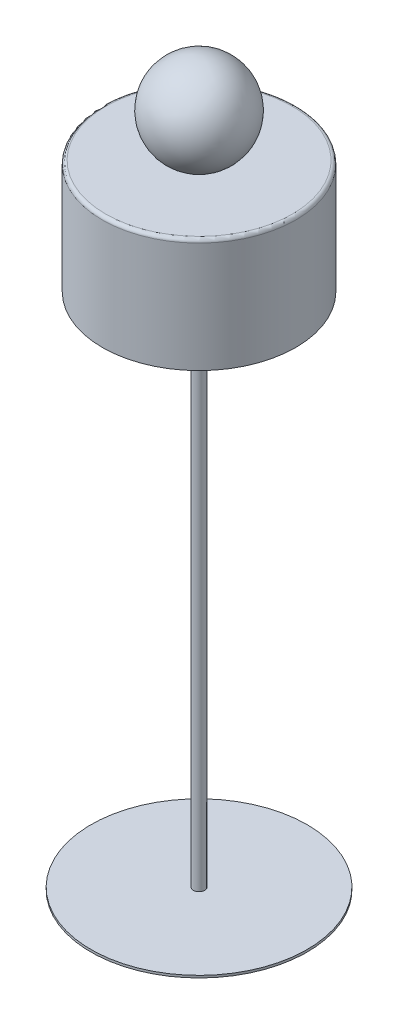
ISO-10303-21;
HEADER;
FILE_DESCRIPTION(('STEP AP214'),'2;1');
FILE_NAME('part.step','',(''),(''),'','','');
FILE_SCHEMA(('AUTOMOTIVE_DESIGN { 1 0 10303 214 1 1 1 1 }'));
ENDSEC;
DATA;
#1=APPLICATION_CONTEXT('core data for automotive mechanical design processes');
#2=APPLICATION_PROTOCOL_DEFINITION('international standard','automotive_design',2000,#1);
#3=PRODUCT_CONTEXT('',#1,'mechanical');
#4=PRODUCT('Part','Part','',(#3));
#5=PRODUCT_RELATED_PRODUCT_CATEGORY('part','',(#4));
#6=PRODUCT_DEFINITION_FORMATION('','',#4);
#7=PRODUCT_DEFINITION_CONTEXT('part definition',#1,'design');
#8=PRODUCT_DEFINITION('design','',#6,#7);
#9=PRODUCT_DEFINITION_SHAPE('','',#8);
#10=(LENGTH_UNIT() NAMED_UNIT(*) SI_UNIT(.MILLI.,.METRE.));
#11=(NAMED_UNIT(*) PLANE_ANGLE_UNIT() SI_UNIT($,.RADIAN.));
#12=(NAMED_UNIT(*) SI_UNIT($,.STERADIAN.) SOLID_ANGLE_UNIT());
#13=UNCERTAINTY_MEASURE_WITH_UNIT(LENGTH_MEASURE(1.E-05),#10,'distance_accuracy_value','');
#14=(GEOMETRIC_REPRESENTATION_CONTEXT(3) GLOBAL_UNCERTAINTY_ASSIGNED_CONTEXT((#13)) GLOBAL_UNIT_ASSIGNED_CONTEXT((#10,
#11,#12)) REPRESENTATION_CONTEXT('',''));
#15=CARTESIAN_POINT('',(0.,0.,0.));
#16=DIRECTION('',(0.,0.,1.));
#17=DIRECTION('',(1.,0.,0.));
#18=AXIS2_PLACEMENT_3D('',#15,#16,#17);
#19=CARTESIAN_POINT('',(0.,-455.,0.));
#20=DIRECTION('',(0.,1.,0.));
#21=DIRECTION('',(0.,0.,1.));
#22=AXIS2_PLACEMENT_3D('',#19,#20,#21);
#23=CYLINDRICAL_SURFACE('',#22,95.);
#24=CARTESIAN_POINT('',(0.,-455.,0.));
#25=DIRECTION('',(0.,-1.,0.));
#26=DIRECTION('',(0.,0.,-1.));
#27=AXIS2_PLACEMENT_3D('',#24,#25,#26);
#28=CIRCLE('',#27,95.);
#29=CARTESIAN_POINT('',(0.,-455.,-95.));
#30=VERTEX_POINT('',#29);
#31=EDGE_CURVE('E11',#30,#30,#28,.T.);
#32=ORIENTED_EDGE('',*,*,#31,.F.);
#33=EDGE_LOOP('',(#32));
#34=FACE_BOUND('',#33,.T.);
#35=CARTESIAN_POINT('',(0.,-453.,0.));
#36=DIRECTION('',(0.,-1.,0.));
#37=DIRECTION('',(0.,0.,-1.));
#38=AXIS2_PLACEMENT_3D('',#35,#36,#37);
#39=CIRCLE('',#38,95.);
#40=CARTESIAN_POINT('',(0.,-453.,-95.));
#41=VERTEX_POINT('',#40);
#42=EDGE_CURVE('E51',#41,#41,#39,.T.);
#43=ORIENTED_EDGE('',*,*,#42,.T.);
#44=EDGE_LOOP('',(#43));
#45=FACE_BOUND('',#44,.T.);
#46=ADVANCED_FACE('F48',(#34,#45),#23,.T.);
#47=CARTESIAN_POINT('',(0.,-455.,0.));
#48=DIRECTION('',(0.,-1.,0.));
#49=DIRECTION('',(0.,0.,-1.));
#50=AXIS2_PLACEMENT_3D('',#47,#48,#49);
#51=PLANE('',#50);
#52=ORIENTED_EDGE('',*,*,#31,.T.);
#53=EDGE_LOOP('',(#52));
#54=FACE_BOUND('',#53,.T.);
#55=ADVANCED_FACE('F63',(#54),#51,.T.);
#56=CARTESIAN_POINT('',(0.,-453.,0.));
#57=DIRECTION('',(0.,-1.,0.));
#58=DIRECTION('',(0.,0.,-1.));
#59=AXIS2_PLACEMENT_3D('',#56,#57,#58);
#60=PLANE('',#59);
#61=ORIENTED_EDGE('',*,*,#42,.F.);
#62=EDGE_LOOP('',(#61));
#63=FACE_BOUND('',#62,.T.);
#64=ADVANCED_FACE('F61',(#63),#60,.F.);
#65=CLOSED_SHELL('',(#46,#55,#64));
#66=MANIFOLD_SOLID_BREP('B2',#65);
#67=CARTESIAN_POINT('',(0.,-453.,0.));
#68=DIRECTION('',(0.,1.,0.));
#69=DIRECTION('',(0.,0.,1.));
#70=AXIS2_PLACEMENT_3D('',#67,#68,#69);
#71=CYLINDRICAL_SURFACE('',#70,5.);
#72=CARTESIAN_POINT('',(0.,-453.,0.));
#73=DIRECTION('',(0.,-1.,0.));
#74=DIRECTION('',(0.,0.,-1.));
#75=AXIS2_PLACEMENT_3D('',#72,#73,#74);
#76=CIRCLE('',#75,5.);
#77=CARTESIAN_POINT('',(0.,-453.,-5.));
#78=VERTEX_POINT('',#77);
#79=EDGE_CURVE('E47',#78,#78,#76,.T.);
#80=ORIENTED_EDGE('',*,*,#79,.F.);
#81=EDGE_LOOP('',(#80));
#82=FACE_BOUND('',#81,.T.);
#83=CARTESIAN_POINT('',(0.,47.,0.));
#84=DIRECTION('',(0.,-1.,0.));
#85=DIRECTION('',(0.,0.,-1.));
#86=AXIS2_PLACEMENT_3D('',#83,#84,#85);
#87=CIRCLE('',#86,5.);
#88=CARTESIAN_POINT('',(0.,47.,-5.));
#89=VERTEX_POINT('',#88);
#90=EDGE_CURVE('E106',#89,#89,#87,.T.);
#91=ORIENTED_EDGE('',*,*,#90,.T.);
#92=EDGE_LOOP('',(#91));
#93=FACE_BOUND('',#92,.T.);
#94=ADVANCED_FACE('F103',(#82,#93),#71,.T.);
#95=CARTESIAN_POINT('',(0.,-453.,0.));
#96=DIRECTION('',(0.,-1.,0.));
#97=DIRECTION('',(0.,0.,-1.));
#98=AXIS2_PLACEMENT_3D('',#95,#96,#97);
#99=PLANE('',#98);
#100=ORIENTED_EDGE('',*,*,#79,.T.);
#101=EDGE_LOOP('',(#100));
#102=FACE_BOUND('',#101,.T.);
#103=ADVANCED_FACE('F118',(#102),#99,.T.);
#104=CARTESIAN_POINT('',(0.,47.,0.));
#105=DIRECTION('',(0.,-1.,0.));
#106=DIRECTION('',(0.,0.,-1.));
#107=AXIS2_PLACEMENT_3D('',#104,#105,#106);
#108=PLANE('',#107);
#109=ORIENTED_EDGE('',*,*,#90,.F.);
#110=EDGE_LOOP('',(#109));
#111=FACE_BOUND('',#110,.T.);
#112=ADVANCED_FACE('F116',(#111),#108,.F.);
#113=CLOSED_SHELL('',(#94,#103,#112));
#114=MANIFOLD_SOLID_BREP('B6',#113);
#115=CARTESIAN_POINT('',(0.,47.,0.));
#116=DIRECTION('',(0.,1.,0.));
#117=DIRECTION('',(0.,0.,1.));
#118=AXIS2_PLACEMENT_3D('',#115,#116,#117);
#119=CYLINDRICAL_SURFACE('',#118,34.872718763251);
#120=CARTESIAN_POINT('',(0.,47.,0.));
#121=DIRECTION('',(0.,-1.,0.));
#122=DIRECTION('',(0.,0.,-1.));
#123=AXIS2_PLACEMENT_3D('',#120,#121,#122);
#124=CIRCLE('',#123,34.872718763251);
#125=CARTESIAN_POINT('',(0.,47.,-34.872718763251));
#126=VERTEX_POINT('',#125);
#127=EDGE_CURVE('E102',#126,#126,#124,.T.);
#128=ORIENTED_EDGE('',*,*,#127,.F.);
#129=EDGE_LOOP('',(#128));
#130=FACE_BOUND('',#129,.T.);
#131=CARTESIAN_POINT('',(0.,97.,0.));
#132=DIRECTION('',(0.,-1.,0.));
#133=DIRECTION('',(0.,0.,-1.));
#134=AXIS2_PLACEMENT_3D('',#131,#132,#133);
#135=CIRCLE('',#134,34.872718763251);
#136=CARTESIAN_POINT('',(0.,97.,-34.872718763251));
#137=VERTEX_POINT('',#136);
#138=EDGE_CURVE('E159',#137,#137,#135,.T.);
#139=ORIENTED_EDGE('',*,*,#138,.T.);
#140=EDGE_LOOP('',(#139));
#141=FACE_BOUND('',#140,.T.);
#142=ADVANCED_FACE('F156',(#130,#141),#119,.T.);
#143=CARTESIAN_POINT('',(0.,47.,0.));
#144=DIRECTION('',(0.,-1.,0.));
#145=DIRECTION('',(0.,0.,-1.));
#146=AXIS2_PLACEMENT_3D('',#143,#144,#145);
#147=PLANE('',#146);
#148=ORIENTED_EDGE('',*,*,#127,.T.);
#149=EDGE_LOOP('',(#148));
#150=FACE_BOUND('',#149,.T.);
#151=ADVANCED_FACE('F171',(#150),#147,.T.);
#152=CARTESIAN_POINT('',(0.,97.,0.));
#153=DIRECTION('',(0.,-1.,0.));
#154=DIRECTION('',(0.,0.,-1.));
#155=AXIS2_PLACEMENT_3D('',#152,#153,#154);
#156=PLANE('',#155);
#157=ORIENTED_EDGE('',*,*,#138,.F.);
#158=EDGE_LOOP('',(#157));
#159=FACE_BOUND('',#158,.T.);
#160=ADVANCED_FACE('F169',(#159),#156,.F.);
#161=CLOSED_SHELL('',(#142,#151,#160));
#162=MANIFOLD_SOLID_BREP('B42',#161);
#163=CARTESIAN_POINT('',(0.,137.960540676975,0.));
#164=DIRECTION('',(1.,0.,0.));
#165=DIRECTION('',(0.,-1.,0.));
#166=AXIS2_PLACEMENT_3D('',#163,#164,#165);
#167=SPHERICAL_SURFACE('',#166,40.);
#168=CARTESIAN_POINT('',(40.,137.960540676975,0.));
#169=VERTEX_POINT('',#168);
#170=VERTEX_LOOP('',#169);
#171=FACE_BOUND('',#170,.T.);
#172=ADVANCED_FACE('F210',(#171),#167,.T.);
#173=CLOSED_SHELL('',(#172));
#174=MANIFOLD_SOLID_BREP('B97',#173);
#175=CARTESIAN_POINT('',(0.,100.,0.));
#176=DIRECTION('',(0.,-1.,0.));
#177=DIRECTION('',(0.,0.,-1.));
#178=AXIS2_PLACEMENT_3D('',#175,#176,#177);
#179=CYLINDRICAL_SURFACE('',#178,85.);
#180=CARTESIAN_POINT('',(0.,97.,0.));
#181=DIRECTION('',(0.,1.,0.));
#182=DIRECTION('',(0.,0.,1.));
#183=AXIS2_PLACEMENT_3D('',#180,#181,#182);
#184=CIRCLE('',#183,85.);
#185=CARTESIAN_POINT('',(0.,97.,85.));
#186=VERTEX_POINT('',#185);
#187=EDGE_CURVE('E209',#186,#186,#184,.F.);
#188=ORIENTED_EDGE('',*,*,#187,.T.);
#189=EDGE_LOOP('',(#188));
#190=FACE_BOUND('',#189,.T.);
#191=CARTESIAN_POINT('',(0.,0.,0.));
#192=DIRECTION('',(0.,1.,0.));
#193=DIRECTION('',(0.,0.,1.));
#194=AXIS2_PLACEMENT_3D('',#191,#192,#193);
#195=CIRCLE('',#194,85.);
#196=CARTESIAN_POINT('',(0.,0.,85.));
#197=VERTEX_POINT('',#196);
#198=EDGE_CURVE('E239',#197,#197,#195,.T.);
#199=ORIENTED_EDGE('',*,*,#198,.T.);
#200=EDGE_LOOP('',(#199));
#201=FACE_BOUND('',#200,.T.);
#202=ADVANCED_FACE('F228',(#190,#201),#179,.T.);
#203=CARTESIAN_POINT('',(0.,100.,0.));
#204=DIRECTION('',(0.,1.,0.));
#205=DIRECTION('',(0.,0.,1.));
#206=AXIS2_PLACEMENT_3D('',#203,#204,#205);
#207=PLANE('',#206);
#208=CARTESIAN_POINT('',(0.,100.,0.));
#209=DIRECTION('',(0.,1.,0.));
#210=DIRECTION('',(0.,0.,1.));
#211=AXIS2_PLACEMENT_3D('',#208,#209,#210);
#212=CIRCLE('',#211,82.);
#213=CARTESIAN_POINT('',(0.,100.,82.));
#214=VERTEX_POINT('',#213);
#215=EDGE_CURVE('E235',#214,#214,#212,.T.);
#216=ORIENTED_EDGE('',*,*,#215,.T.);
#217=EDGE_LOOP('',(#216));
#218=FACE_BOUND('',#217,.T.);
#219=ADVANCED_FACE('F264',(#218),#207,.T.);
#220=CARTESIAN_POINT('',(0.,0.,0.));
#221=DIRECTION('',(0.,1.,0.));
#222=DIRECTION('',(0.,0.,1.));
#223=AXIS2_PLACEMENT_3D('',#220,#221,#222);
#224=PLANE('',#223);
#225=CARTESIAN_POINT('',(0.,0.,0.));
#226=DIRECTION('',(0.,1.,0.));
#227=DIRECTION('',(0.,0.,1.));
#228=AXIS2_PLACEMENT_3D('',#225,#226,#227);
#229=CIRCLE('',#228,82.);
#230=CARTESIAN_POINT('',(0.,0.,82.));
#231=VERTEX_POINT('',#230);
#232=EDGE_CURVE('E246',#231,#231,#229,.T.);
#233=ORIENTED_EDGE('',*,*,#232,.T.);
#234=EDGE_LOOP('',(#233));
#235=FACE_BOUND('',#234,.T.);
#236=ORIENTED_EDGE('',*,*,#198,.F.);
#237=EDGE_LOOP('',(#236));
#238=FACE_BOUND('',#237,.T.);
#239=ADVANCED_FACE('F268',(#235,#238),#224,.F.);
#240=CARTESIAN_POINT('',(0.,97.,0.));
#241=DIRECTION('',(0.,1.,0.));
#242=DIRECTION('',(0.,0.,1.));
#243=AXIS2_PLACEMENT_3D('',#240,#241,#242);
#244=TOROIDAL_SURFACE('',#243,82.,3.);
#245=ORIENTED_EDGE('',*,*,#187,.F.);
#246=EDGE_LOOP('',(#245));
#247=FACE_BOUND('',#246,.T.);
#248=ORIENTED_EDGE('',*,*,#215,.F.);
#249=EDGE_LOOP('',(#248));
#250=FACE_BOUND('',#249,.T.);
#251=ADVANCED_FACE('F230',(#247,#250),#244,.T.);
#252=CARTESIAN_POINT('',(0.,100.,0.));
#253=DIRECTION('',(0.,-1.,0.));
#254=DIRECTION('',(0.,0.,-1.));
#255=AXIS2_PLACEMENT_3D('',#252,#253,#254);
#256=CYLINDRICAL_SURFACE('',#255,82.);
#257=CARTESIAN_POINT('',(0.,97.,0.));
#258=DIRECTION('',(0.,1.,0.));
#259=DIRECTION('',(0.,0.,1.));
#260=AXIS2_PLACEMENT_3D('',#257,#258,#259);
#261=CIRCLE('',#260,82.);
#262=CARTESIAN_POINT('',(0.,97.,82.));
#263=VERTEX_POINT('',#262);
#264=EDGE_CURVE('E243',#263,#263,#261,.T.);
#265=ORIENTED_EDGE('',*,*,#264,.T.);
#266=EDGE_LOOP('',(#265));
#267=FACE_BOUND('',#266,.T.);
#268=ORIENTED_EDGE('',*,*,#232,.F.);
#269=EDGE_LOOP('',(#268));
#270=FACE_BOUND('',#269,.T.);
#271=ADVANCED_FACE('F252',(#267,#270),#256,.F.);
#272=CARTESIAN_POINT('',(0.,97.,0.));
#273=DIRECTION('',(0.,1.,0.));
#274=DIRECTION('',(0.,0.,1.));
#275=AXIS2_PLACEMENT_3D('',#272,#273,#274);
#276=PLANE('',#275);
#277=ORIENTED_EDGE('',*,*,#264,.F.);
#278=EDGE_LOOP('',(#277));
#279=FACE_BOUND('',#278,.T.);
#280=ADVANCED_FACE('F255',(#279),#276,.F.);
#281=CLOSED_SHELL('',(#202,#219,#239,#251,#271,#280));
#282=MANIFOLD_SOLID_BREP('B152',#281);
#283=ADVANCED_BREP_SHAPE_REPRESENTATION('',(#18,#66,#114,#162,#174,#282),#14);
#284=SHAPE_DEFINITION_REPRESENTATION(#9,#283);
ENDSEC;
END-ISO-10303-21;
